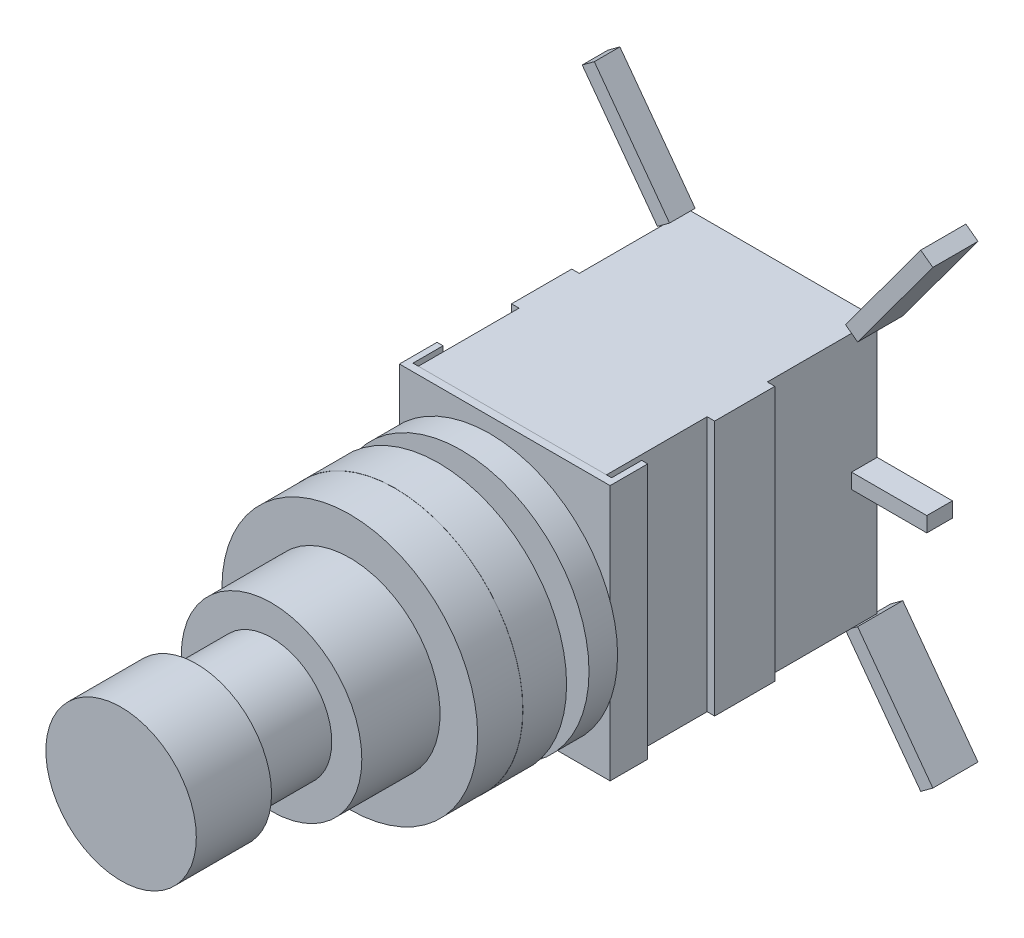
from build123d import *

# Parameters (mm, degrees)
SKETCH_2_R              = 6
EXTRUDE_1_DEPTH         = 5.2
SKETCH_3_R              = 4
EXTRUDE_2_DEPTH         = 5
SKETCH_4_R              = 5
EXTRUDE_3_DEPTH         = 5
SKETCH_5_R              = 8.5
EXTRUDE_4_DEPTH         = 3
SKETCH_6_R              = 8.51
EXTRUDE_6_DEPTH         = 2.9
EXTRUDE_START           = 1.5
SKETCH_7_R              = 6
EXTRUDE_7_DEPTH         = 1.5
SKETCH_8_R              = 8.5
EXTRUDE_8_DEPTH         = 1.9
EXTRUDE_START_2         = 0.5
SKETCH_9_R              = 6
EXTRUDE_9_DEPTH         = 0.5
SKETCH_10_R             = 7
EXTRUDE_10_DEPTH        = 0.5
SKETCH_11_W             = 14
SKETCH_11_H             = 17
EXTRUDE_11_DEPTH        = 0.5
SKETCH_12_W             = 0.4
SKETCH_12_H             = 17
EXTRUDE_12_DEPTH        = 2
SKETCH_13_W             = 12.5
SKETCH_13_H             = 16.98
EXTRUDE_14_DEPTH        = 18
SKETCH_15_W             = 4
SKETCH_15_H             = 16.98
EXTRUDE_15_DEPTH        = 0.5
SKETCH_16_W             = 4
SKETCH_16_H             = 16.98
EXTRUDE_16_DEPTH        = 0.5
SKETCH_17_W             = 1.7
SKETCH_17_H             = 1
EXTRUDE_17_DEPTH        = 5
SKETCH_18_W             = 1.7
SKETCH_18_H             = 1
EXTRUDE_18_DEPTH        = 5
EXTRUDE_19_DEPTH        = 0.5
EXTRUDE_19_DEPTH_BACK   = 0.5
EXTRUDE_19_2_DEPTH      = 0.5
EXTRUDE_19_2_DEPTH_BACK = 0.5
EXTRUDE_20_DEPTH        = 0.5
EXTRUDE_20_DEPTH_BACK   = 0.5
EXTRUDE_20_2_DEPTH      = 0.5
EXTRUDE_20_2_DEPTH_BACK = 0.5


with BuildPart() as part:
    # Sketch 2 → Extrude 1 (new body)
    with BuildSketch(Plane.XY):
        Circle(SKETCH_2_R)
    extrude(amount=EXTRUDE_1_DEPTH)

    # Sketch 3 → Extrude 2 (add)
    with BuildSketch(Plane.XY.offset(5.2)):
        Circle(SKETCH_3_R)
    extrude(amount=EXTRUDE_2_DEPTH)

    # Sketch 4 → Extrude 3 (add)
    with BuildSketch(Plane.XY.offset(10.2)):
        Circle(SKETCH_4_R)
    extrude(amount=EXTRUDE_3_DEPTH)

    # Sketch 5 → Extrude 4 (add)
    with BuildSketch(Plane(origin=(0, 0, 0), x_dir=(-1, 0, 0), z_dir=(0, 0, -1))):
        Circle(SKETCH_5_R)
    extrude(amount=EXTRUDE_4_DEPTH)

    # Sketch 6 → Extrude 6 (add)
    with BuildSketch(Plane(origin=(0, 0, -3), x_dir=(-1, 0, 0), z_dir=(0, 0, -1))):
        Circle(SKETCH_6_R)
    extrude(amount=EXTRUDE_6_DEPTH)

    # Sketch 7 → Extrude 7 (add)
    with BuildSketch(Plane(origin=(0, 0, -5.9), x_dir=(-1, 0, 0), z_dir=(0, 0, -1)).offset(EXTRUDE_START)):
        Circle(SKETCH_7_R)
    extrude(amount=-EXTRUDE_7_DEPTH)

    # Sketch 8 → Extrude 8 (add)
    with BuildSketch(Plane(origin=(0, 0, -7.4), x_dir=(-1, 0, 0), z_dir=(0, 0, -1))):
        Circle(SKETCH_8_R)
    extrude(amount=EXTRUDE_8_DEPTH)

    # Sketch 9 → Extrude 9 (add)
    with BuildSketch(Plane(origin=(0, 0, -9.3), x_dir=(-1, 0, 0), z_dir=(0, 0, -1)).offset(EXTRUDE_START_2)):
        Circle(SKETCH_9_R)
    extrude(amount=-EXTRUDE_9_DEPTH)

    # Sketch 10 → Extrude 10 (add)
    with BuildSketch(Plane(origin=(0, 0, -9.8), x_dir=(-1, 0, 0), z_dir=(0, 0, -1))):
        Circle(SKETCH_10_R)
    extrude(amount=EXTRUDE_10_DEPTH)

    # Sketch 11 → Extrude 11 (add)
    with BuildSketch(Plane(origin=(0, 0, -10.3), x_dir=(-1, 0, 0), z_dir=(0, 0, -1))):
        Rectangle(SKETCH_11_W, SKETCH_11_H)
    extrude(amount=EXTRUDE_11_DEPTH)

    # Sketch 12 → Extrude 12 (add)
    with BuildSketch(Plane(origin=(0, 0, -10.8), x_dir=(-1, 0, 0), z_dir=(0, 0, -1))):
        with Locations((-6.8, 0)):
            Rectangle(SKETCH_12_W, SKETCH_12_H)
        with Locations((6.8, 0)):
            Rectangle(SKETCH_12_W, SKETCH_12_H)
    extrude(amount=EXTRUDE_12_DEPTH)

    # Sketch 13 → Extrude 14 (add)
    with BuildSketch(Plane(origin=(0, 0, -10.8), x_dir=(-1, 0, 0), z_dir=(0, 0, -1))):
        Rectangle(SKETCH_13_W, SKETCH_13_H)
    extrude(amount=EXTRUDE_14_DEPTH)

    # Sketch 15 → Extrude 15 (add)
    with BuildSketch(Plane(origin=(6.25, 0, 0), x_dir=(0, 0, -1), z_dir=(1, 0, 0))):
        with Locations((19.5, 0)):
            Rectangle(SKETCH_15_W, SKETCH_15_H)
    extrude(amount=EXTRUDE_15_DEPTH)

    # Sketch 16 → Extrude 16 (add)
    with BuildSketch(Plane.ZY.offset(6.25)):
        with Locations((-19.5, 0)):
            Rectangle(SKETCH_16_W, SKETCH_16_H)
    extrude(amount=EXTRUDE_16_DEPTH)

    # Sketch 17 → Extrude 17 (add)
    with BuildSketch(Plane.ZY.offset(6.25)):
        with Locations((-27.95, 0)):
            Rectangle(SKETCH_17_W, SKETCH_17_H)
    extrude(amount=EXTRUDE_17_DEPTH)

    # Sketch 18 → Extrude 18 (add)
    with BuildSketch(Plane(origin=(6.25, 0, 0), x_dir=(0, 0, -1), z_dir=(1, 0, 0))):
        with Locations((27.95, 0)):
            Rectangle(SKETCH_18_W, SKETCH_18_H)
    extrude(amount=EXTRUDE_18_DEPTH)


with BuildPart() as body_2:
    # Sketch 3 2 → Extrude 19 (new, two sides: drawn at the far end of the back side and taken through both)
    with BuildSketch(Plane(origin=(-6.25, 8.49, -28.8), x_dir=(0.5918623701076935, -0.8039858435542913, 0.057495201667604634), z_dir=(0.8053180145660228, 0.5928430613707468, 0)).offset(-EXTRUDE_19_DEPTH_BACK)):
        Polygon((0, 0), (-8.4199837, -0.484910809), (-8.322241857, -2.182098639), (0.097741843, -1.697187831), align=None)
    extrude(amount=EXTRUDE_19_DEPTH + EXTRUDE_19_DEPTH_BACK)


with BuildPart() as body_3:
    # Sketch 3 2 → Extrude 19 2 (new, two sides: drawn at the far end of the back side and taken through both)
    with BuildSketch(Plane(origin=(-6.25, 8.49, -28.8), x_dir=(0.5918623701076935, -0.8039858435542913, 0.057495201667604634), z_dir=(0.8053180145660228, 0.5928430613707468, 0)).offset(-EXTRUDE_19_2_DEPTH_BACK)):
        Polygon((20.975215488, 2.510126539), (29.395199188, 2.995037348), (29.567684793, 0), (21.147701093, -0.484910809), align=None)
    extrude(amount=EXTRUDE_19_2_DEPTH + EXTRUDE_19_2_DEPTH_BACK)


with BuildPart() as body_4:
    # Sketch 6 2 → Extrude 20 (new, two sides: drawn at the far end of the back side and taken through both)
    with BuildSketch(Plane(origin=(6.25, 8.49, -30.1), x_dir=(-0.5898049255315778, -0.8011910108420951, 0.1011094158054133), z_dir=(-0.8053180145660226, 0.592843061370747, 0)).offset(-EXTRUDE_20_DEPTH_BACK)):
        Polygon((0, 0), (-8.390713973, 0.852750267), (-8.087385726, 3.837376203), (0.303328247, 2.984625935), align=None)
    extrude(amount=EXTRUDE_20_DEPTH + EXTRUDE_20_DEPTH_BACK)


with BuildPart() as body_5:
    # Sketch 6 2 → Extrude 20 2 (new, two sides: drawn at the far end of the back side and taken through both)
    with BuildSketch(Plane(origin=(6.25, 8.49, -30.1), x_dir=(-0.5898049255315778, -0.8011910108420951, 0.1011094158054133), z_dir=(-0.8053180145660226, 0.592843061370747, 0)).offset(-EXTRUDE_20_2_DEPTH_BACK)):
        Polygon((21.280113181, 0.852750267), (29.670827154, 0), (29.367498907, -2.984625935), (20.976784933, -2.131875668), align=None)
    extrude(amount=EXTRUDE_20_2_DEPTH + EXTRUDE_20_2_DEPTH_BACK)


solid = Compound([part.part, body_2.part, body_3.part, body_4.part, body_5.part])
